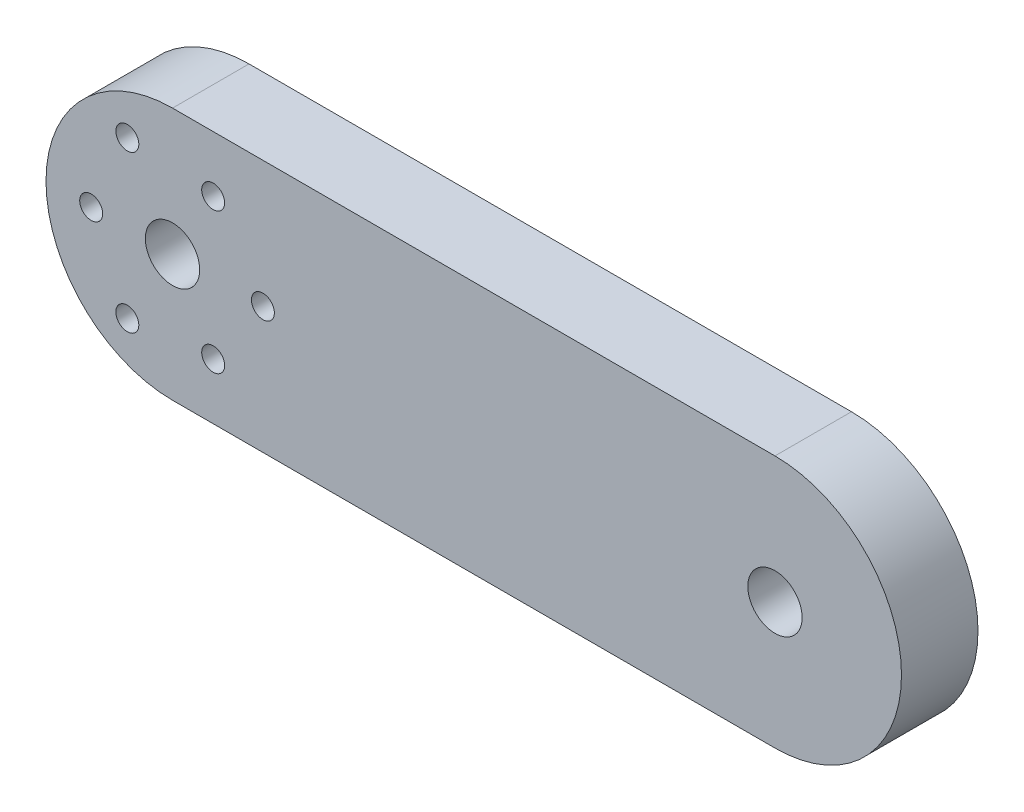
from build123d import *

# Parameters (mm, degrees)
SKETCH1_R           = 4.5085
SKETCH1_R_2         = 1.905
BOSS_EXTRUDE2_DEPTH = 12.7


with BuildPart() as part:
    # Sketch1 → Boss-Extrude2 (new body)
    with BuildSketch(Plane.XY):
        with BuildLine():
            Line((0, 21), (100, 21))
            ThreePointArc((100, 21), (121, 0), (100, -21))
            Line((100, -21), (0, -21))
            ThreePointArc((0, -21), (-21, 0), (0, 21))
        make_face()
        with Locations((100, 0)):
            Circle(SKETCH1_R, mode=Mode.SUBTRACT)
        with Locations((15, 0)):
            Circle(SKETCH1_R_2, mode=Mode.SUBTRACT)
        with Locations((-7.5, -12.990381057)):
            Circle(SKETCH1_R_2, mode=Mode.SUBTRACT)
        with Locations((-7.5, 12.990381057)):
            Circle(SKETCH1_R_2, mode=Mode.SUBTRACT)
        Circle(SKETCH1_R, mode=Mode.SUBTRACT)
        with Locations((-13.5, 0)):
            Circle(SKETCH1_R_2, mode=Mode.SUBTRACT)
        with Locations((6.75, 11.691342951)):
            Circle(SKETCH1_R_2, mode=Mode.SUBTRACT)
        with Locations((6.75, -11.691342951)):
            Circle(SKETCH1_R_2, mode=Mode.SUBTRACT)
    extrude(amount=BOSS_EXTRUDE2_DEPTH)


solid = part.part
